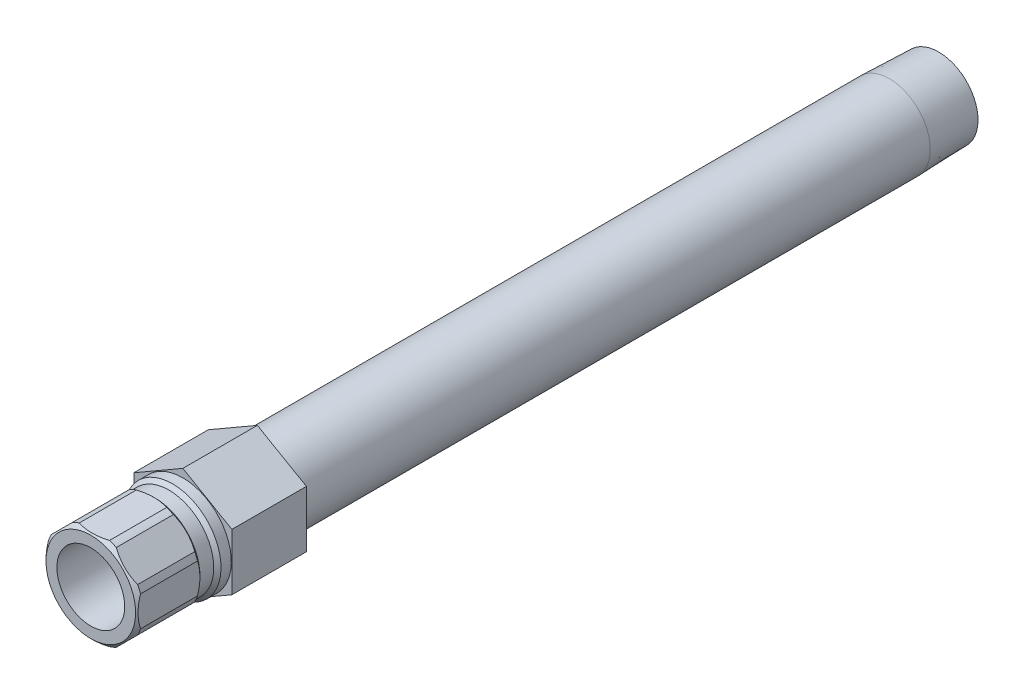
from build123d import *

# Parameters (mm, degrees)
SKETCH2_R           = 6.2611
BOSS_EXTRUDE1_DEPTH = 15.621
CUT_EXTRUDE1_START  = 5.8166
SKETCH3_OUTSIDE_W   = 58.686
SKETCH3_OUTSIDE_H   = 61.868
CUT_EXTRUDE1_DEPTH  = 154.456438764


with BuildPart() as part:
    # Sketch1 → Revolve1 (revolve)
    with BuildSketch(Plane(origin=(0, 0, 0), x_dir=(0, 0, -1), z_dir=(1, 0, 0))):
        Polygon((-19.304, 7.112), (-19.304, 9.398), (-18.542, 10.16), (-6.5786, 10.16), (-5.8166, 9.398), (-2.921, 9.398), (-2.159, 10.16), (0, 10.16), (0, 8.5725), (148.1582, 8.5725), (158.496, 8.249445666), (158.496, 6.2611), (-0.6731, 6.2611), (-1.524, 7.112), align=None)
    revolve(axis=Axis((0, 0, 0), (0, 0, 1)))

    # Sketch2 → Boss-Extrude1 (add)
    with BuildSketch(Plane.XY):
        Polygon((-10.287, 5.939202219), (-10.287, -5.939202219), (0, -11.878404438), (10.287, -5.939202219), (10.287, 5.939202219), (0, 11.878404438), align=None)
        with Locations(Location((0, 0, 0), (0, 0, 90))):
            Circle(SKETCH2_R, mode=Mode.SUBTRACT)
    extrude(amount=-BOSS_EXTRUDE1_DEPTH)

    # Sketch3 outside → Cut-Extrude1 (cut, through all)
    with BuildSketch(Plane.XY.offset(CUT_EXTRUDE1_START)):
        Rectangle(SKETCH3_OUTSIDE_W, SKETCH3_OUTSIDE_H)
        Polygon((9.652, -3.997989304), (9.652, 3.997989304), (3.997989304, 9.652), (-3.997989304, 9.652), (-9.652, 3.997989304), (-9.652, -3.997989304), (-3.997989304, -9.652), (3.997989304, -9.652), align=None, mode=Mode.SUBTRACT)
    extrude(amount=CUT_EXTRUDE1_DEPTH, mode=Mode.SUBTRACT)


solid = part.part
